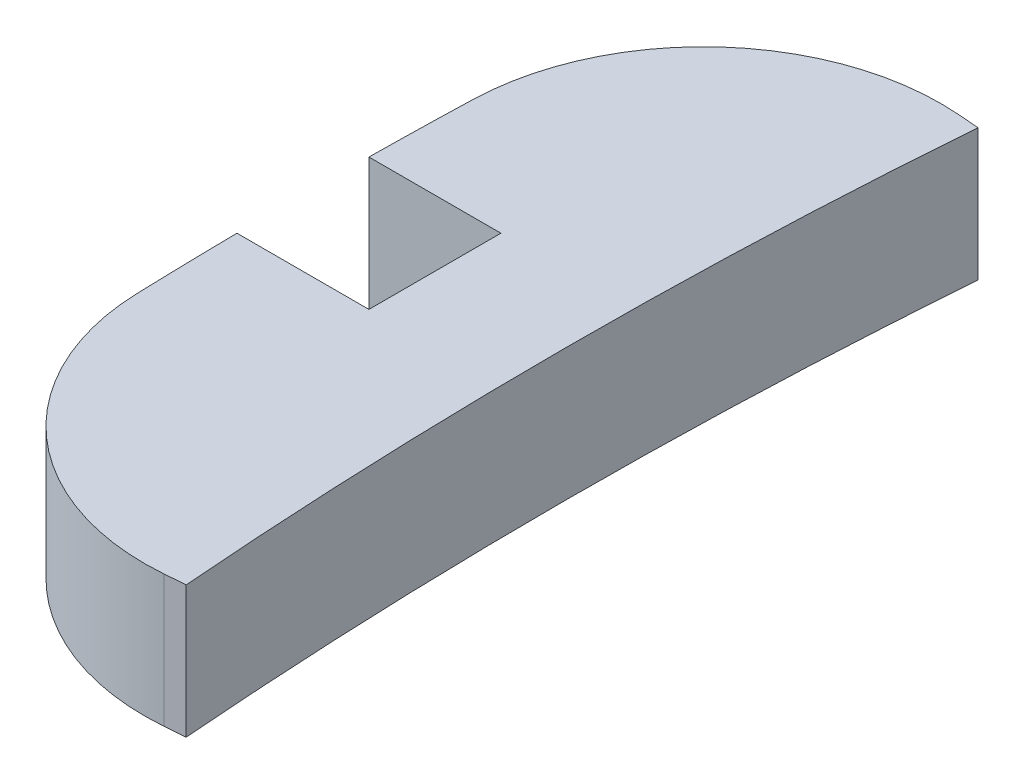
from build123d import *

# Parameters (mm, degrees)
AUFSATZ_LINEAR_AUSTRAGEN1_DEPTH = 5


with BuildPart() as part:
    # Skizze2 → Aufsatz-Linear austragen1 (new body)
    with BuildSketch(Plane(origin=(0, 0, 0), x_dir=(1, 0, 0), z_dir=(0, 1, 0))):
        with BuildLine():
            Line((-190.895325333, 15.062030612), (-190.109152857, 15))
            ThreePointArc((-190.109152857, 15), (-190.7, 0), (-190.109152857, -15))
            Line((-190.109152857, -15), (-190.895325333, -15.062030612))
            ThreePointArc((-190.895325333, -15.062030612), (-197.606022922, -12.795632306), (-200.598700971, -6.375826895))
            ThreePointArc((-200.598700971, -6.375826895), (-200.650923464, -4.438120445), (-200.684428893, -2.5))
            Line((-200.684428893, -2.5), (-195.684428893, -2.5))
            Line((-195.684428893, -2.5), (-195.684428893, 2.5))
            Line((-195.684428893, 2.5), (-200.684428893, 2.5))
            ThreePointArc((-200.684428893, 2.5), (-200.650923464, 4.438120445), (-200.598700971, 6.375826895))
            ThreePointArc((-200.598700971, 6.375826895), (-197.606022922, 12.795632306), (-190.895325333, 15.062030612))
        make_face()
    extrude(amount=AUFSATZ_LINEAR_AUSTRAGEN1_DEPTH)


solid = part.part
